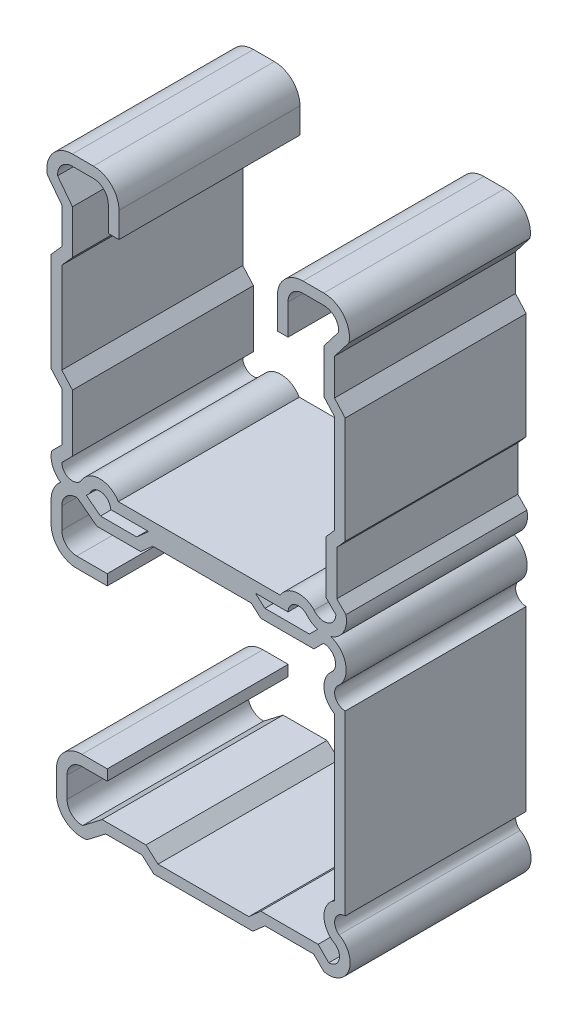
from build123d import *

# Parameters (mm, degrees)
BASE_EXTRUDE_DEPTH = 12.7
CIRPATTERN1_COUNT  = 2
CIRPATTERN1_ANGLE  = 90


with BuildPart() as part:
    # Sketch1 → Base-Extrude (new, symmetric)
    with BuildSketch(Plane(origin=(-20.32, 17.78, 0), x_dir=(1, 0, 0), z_dir=(0, 0, 1))):
        with BuildLine():
            Line((17.3228, 17.075886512), (19.412382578, 19.800133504))
            ThreePointArc((19.412382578, 19.800133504), (18.838545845, 21.346344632), (17.3228, 21.9964))
            Line((17.3228, 21.9964), (14.38577367, 21.9964))
            ThreePointArc((14.38577367, 21.9964), (12.906383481, 21.383616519), (12.2936, 19.90422633))
            Line((12.2936, 19.90422633), (12.2936, 15.61465))
            Line((12.2936, 15.61465), (10.795, 15.61465))
            Line((10.795, 15.61465), (10.795, 19.90422633))
            ThreePointArc((10.795, 19.90422633), (11.846713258, 22.443286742), (14.38577367, 23.495))
            Line((14.38577367, 23.495), (17.3228, 23.495))
            ThreePointArc((17.3228, 23.495), (20.097934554, 22.182884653), (20.844928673, 19.2054666))
            Line((20.844928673, 19.2054666), (18.8214, 16.567335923))
            Line((18.8214, 16.567335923), (18.8214, 11.485729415))
            Line((18.8214, 11.485729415), (20.32, 9.8028125))
            Line((20.32, 9.8028125), (20.32, -5.180962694))
            Line((20.32, -5.180962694), (19.1389, -6.507329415))
            Line((19.1389, -6.507329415), (19.1389, -12.757931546))
            Line((19.1389, -12.757931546), (20.424084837, -14.043116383))
            ThreePointArc((20.424084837, -14.043116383), (18.821804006, -17.54486751), (15.019825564, -16.932883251))
            ThreePointArc((15.019825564, -16.932883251), (13.348875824, -16.363652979), (12.29528328, -17.78))
            Line((12.29528328, -17.78), (-12.61278328, -17.78))
            ThreePointArc((-12.61278328, -17.78), (-13.666375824, -16.363652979), (-15.337325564, -16.932883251))
            ThreePointArc((-15.337325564, -16.932883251), (-19.047442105, -18.270236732), (-20.870958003, -14.773342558))
            Line((-20.870958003, -14.773342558), (-19.4564, -13.358784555))
            Line((-19.4564, -13.358784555), (-19.4564, -6.507329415))
            Line((-19.4564, -6.507329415), (-20.955, -4.8244125))
            Line((-20.955, -4.8244125), (-20.955, 9.0662125))
            Line((-20.955, 9.0662125), (-19.4564, 10.749129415))
            Line((-19.4564, 10.749129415), (-19.4564, 15.830735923))
            Line((-19.4564, 15.830735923), (-21.479928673, 18.4688666))
            ThreePointArc((-21.479928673, 18.4688666), (-20.732934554, 21.446284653), (-17.9578, 22.7584))
            Line((-17.9578, 22.7584), (-15.02077367, 22.7584))
            ThreePointArc((-15.02077367, 22.7584), (-12.481713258, 21.706686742), (-11.43, 19.16762633))
            Line((-11.43, 19.16762633), (-11.43, 15.61465))
            Line((-11.43, 15.61465), (-12.9286, 15.61465))
            Line((-12.9286, 15.61465), (-12.9286, 19.16762633))
            ThreePointArc((-12.9286, 19.16762633), (-13.541383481, 20.647016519), (-15.02077367, 21.2598))
            Line((-15.02077367, 21.2598), (-17.9578, 21.2598))
            ThreePointArc((-17.9578, 21.2598), (-19.473545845, 20.609744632), (-20.047382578, 19.063533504))
            Line((-20.047382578, 19.063533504), (-17.9578, 16.339286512))
            Line((-17.9578, 16.339286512), (-17.9578, 10.17860201))
            Line((-17.9578, 10.17860201), (-19.4564, 8.495685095))
            Line((-19.4564, 8.495685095), (-19.4564, -4.253885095))
            Line((-19.4564, -4.253885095), (-17.9578, -5.93680201))
            Line((-17.9578, -5.93680201), (-17.9578, -13.979525))
            Line((-17.9578, -13.979525), (-19.4564, -15.478125))
            ThreePointArc((-19.4564, -15.478125), (-18.409738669, -16.906954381), (-16.731785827, -16.33992034))
            ThreePointArc((-16.731785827, -16.33992034), (-14.14499029, -14.797667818), (-11.524190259, -16.2814))
            Line((-11.524190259, -16.2814), (11.206690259, -16.2814))
            ThreePointArc((11.206690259, -16.2814), (13.441553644, -14.818250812), (15.956217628, -15.719297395))
            ThreePointArc((15.956217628, -15.719297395), (17.836242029, -16.3415136), (19.00315301, -14.741525))
            Line((19.00315301, -14.741525), (17.6403, -13.37867199))
            Line((17.6403, -13.37867199), (17.6403, -5.93680201))
            Line((17.6403, -5.93680201), (18.8214, -4.610435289))
            Line((18.8214, -4.610435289), (18.8214, 9.232285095))
            Line((18.8214, 9.232285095), (17.3228, 10.91520201))
            Line((17.3228, 10.91520201), (17.3228, 17.075886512))
        make_face()
    base_extrude = extrude(amount=BASE_EXTRUDE_DEPTH, both=True)

    # CirPattern1: Base-Extrude ×2 about axis
    cirpattern1_axis = Axis((0, 0, 0), (0, 0, 1))
    for i in range(1, CIRPATTERN1_COUNT):
        add(base_extrude.rotate(cirpattern1_axis, i * CIRPATTERN1_ANGLE / (CIRPATTERN1_COUNT - 1)))


solid = part.part
